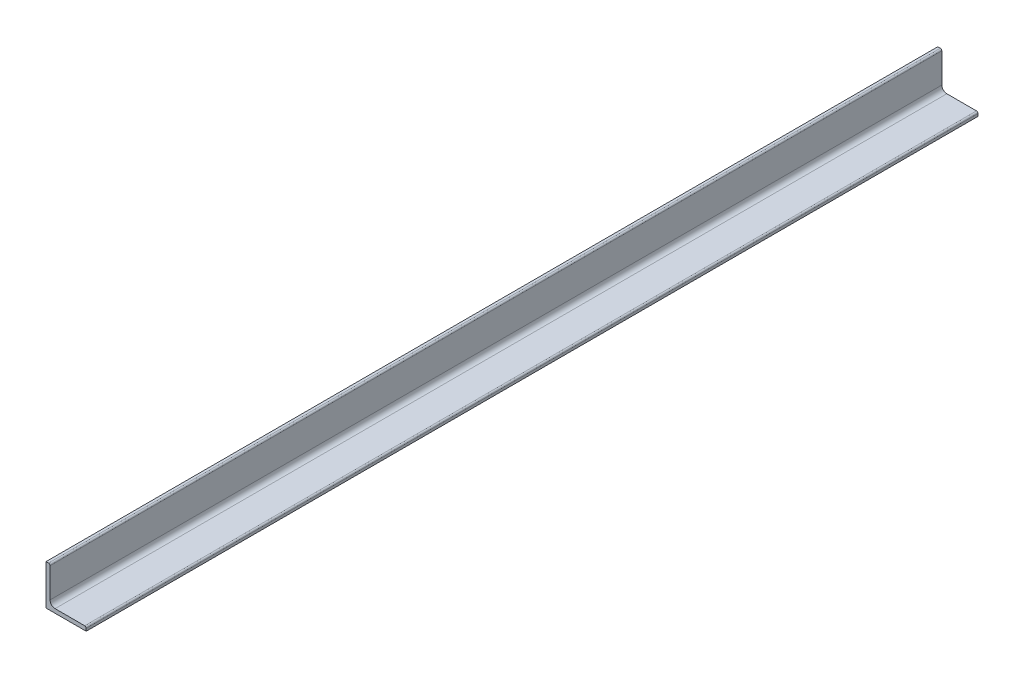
ISO-10303-21;
HEADER;
FILE_DESCRIPTION(('STEP AP214'),'2;1');
FILE_NAME('part.step','',(''),(''),'','','');
FILE_SCHEMA(('AUTOMOTIVE_DESIGN { 1 0 10303 214 1 1 1 1 }'));
ENDSEC;
DATA;
#1=APPLICATION_CONTEXT('core data for automotive mechanical design processes');
#2=APPLICATION_PROTOCOL_DEFINITION('international standard','automotive_design',2000,#1);
#3=PRODUCT_CONTEXT('',#1,'mechanical');
#4=PRODUCT('Part','Part','',(#3));
#5=PRODUCT_RELATED_PRODUCT_CATEGORY('part','',(#4));
#6=PRODUCT_DEFINITION_FORMATION('','',#4);
#7=PRODUCT_DEFINITION_CONTEXT('part definition',#1,'design');
#8=PRODUCT_DEFINITION('design','',#6,#7);
#9=PRODUCT_DEFINITION_SHAPE('','',#8);
#10=(LENGTH_UNIT() NAMED_UNIT(*) SI_UNIT(.MILLI.,.METRE.));
#11=(NAMED_UNIT(*) PLANE_ANGLE_UNIT() SI_UNIT($,.RADIAN.));
#12=(NAMED_UNIT(*) SI_UNIT($,.STERADIAN.) SOLID_ANGLE_UNIT());
#13=UNCERTAINTY_MEASURE_WITH_UNIT(LENGTH_MEASURE(1.E-05),#10,'distance_accuracy_value','');
#14=(GEOMETRIC_REPRESENTATION_CONTEXT(3) GLOBAL_UNCERTAINTY_ASSIGNED_CONTEXT((#13)) GLOBAL_UNIT_ASSIGNED_CONTEXT((#10,
#11,#12)) REPRESENTATION_CONTEXT('',''));
#15=CARTESIAN_POINT('',(0.,0.,0.));
#16=DIRECTION('',(0.,0.,1.));
#17=DIRECTION('',(1.,0.,0.));
#18=AXIS2_PLACEMENT_3D('',#15,#16,#17);
#19=CARTESIAN_POINT('',(2.49999999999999,40.,443.5));
#20=DIRECTION('',(0.,-1.,0.));
#21=DIRECTION('',(0.,0.,-1.));
#22=AXIS2_PLACEMENT_3D('',#19,#20,#21);
#23=PLANE('',#22);
#24=DIRECTION('',(-1.,0.,0.));
#25=VECTOR('',#24,1.);
#26=CARTESIAN_POINT('',(2.49999999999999,40.,-443.5));
#27=LINE('',#26,#25);
#28=CARTESIAN_POINT('',(2.49999999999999,40.,-443.5));
#29=VERTEX_POINT('',#28);
#30=CARTESIAN_POINT('',(0.,40.,-443.5));
#31=VERTEX_POINT('',#30);
#32=EDGE_CURVE('E143',#29,#31,#27,.T.);
#33=ORIENTED_EDGE('',*,*,#32,.T.);
#34=DIRECTION('',(0.,0.,-1.));
#35=VECTOR('',#34,1.);
#36=CARTESIAN_POINT('',(0.,40.,443.5));
#37=LINE('',#36,#35);
#38=CARTESIAN_POINT('',(0.,40.,443.5));
#39=VERTEX_POINT('',#38);
#40=EDGE_CURVE('E11',#39,#31,#37,.T.);
#41=ORIENTED_EDGE('',*,*,#40,.F.);
#42=DIRECTION('',(-1.,0.,0.));
#43=VECTOR('',#42,1.);
#44=CARTESIAN_POINT('',(2.49999999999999,40.,443.5));
#45=LINE('',#44,#43);
#46=CARTESIAN_POINT('',(2.49999999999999,40.,443.5));
#47=VERTEX_POINT('',#46);
#48=EDGE_CURVE('E159',#47,#39,#45,.T.);
#49=ORIENTED_EDGE('',*,*,#48,.F.);
#50=DIRECTION('',(0.,0.,-1.));
#51=VECTOR('',#50,1.);
#52=CARTESIAN_POINT('',(2.49999999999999,40.,443.5));
#53=LINE('',#52,#51);
#54=EDGE_CURVE('E139',#47,#29,#53,.T.);
#55=ORIENTED_EDGE('',*,*,#54,.T.);
#56=EDGE_LOOP('',(#33,#41,#49,#55));
#57=FACE_BOUND('',#56,.T.);
#58=ADVANCED_FACE('F41',(#57),#23,.F.);
#59=CARTESIAN_POINT('',(0.,40.,443.5));
#60=DIRECTION('',(1.,0.,0.));
#61=DIRECTION('',(0.,1.,0.));
#62=AXIS2_PLACEMENT_3D('',#59,#60,#61);
#63=PLANE('',#62);
#64=DIRECTION('',(0.,-1.,0.));
#65=VECTOR('',#64,1.);
#66=CARTESIAN_POINT('',(0.,40.,-443.5));
#67=LINE('',#66,#65);
#68=CARTESIAN_POINT('',(0.,0.,-443.5));
#69=VERTEX_POINT('',#68);
#70=EDGE_CURVE('E146',#31,#69,#67,.T.);
#71=ORIENTED_EDGE('',*,*,#70,.T.);
#72=DIRECTION('',(0.,0.,-1.));
#73=VECTOR('',#72,1.);
#74=CARTESIAN_POINT('',(0.,0.,443.5));
#75=LINE('',#74,#73);
#76=CARTESIAN_POINT('',(0.,0.,443.5));
#77=VERTEX_POINT('',#76);
#78=EDGE_CURVE('E49',#77,#69,#75,.T.);
#79=ORIENTED_EDGE('',*,*,#78,.F.);
#80=DIRECTION('',(0.,-1.,0.));
#81=VECTOR('',#80,1.);
#82=CARTESIAN_POINT('',(0.,40.,443.5));
#83=LINE('',#82,#81);
#84=EDGE_CURVE('E103',#39,#77,#83,.T.);
#85=ORIENTED_EDGE('',*,*,#84,.F.);
#86=ORIENTED_EDGE('',*,*,#40,.T.);
#87=EDGE_LOOP('',(#71,#79,#85,#86));
#88=FACE_BOUND('',#87,.T.);
#89=ADVANCED_FACE('F202',(#88),#63,.F.);
#90=CARTESIAN_POINT('',(0.,0.,443.5));
#91=DIRECTION('',(0.,1.,0.));
#92=DIRECTION('',(0.,0.,1.));
#93=AXIS2_PLACEMENT_3D('',#90,#91,#92);
#94=PLANE('',#93);
#95=DIRECTION('',(1.,0.,0.));
#96=VECTOR('',#95,1.);
#97=CARTESIAN_POINT('',(0.,0.,-443.5));
#98=LINE('',#97,#96);
#99=CARTESIAN_POINT('',(40.,0.,-443.5));
#100=VERTEX_POINT('',#99);
#101=EDGE_CURVE('E148',#69,#100,#98,.T.);
#102=ORIENTED_EDGE('',*,*,#101,.T.);
#103=DIRECTION('',(0.,0.,-1.));
#104=VECTOR('',#103,1.);
#105=CARTESIAN_POINT('',(40.,0.,443.5));
#106=LINE('',#105,#104);
#107=CARTESIAN_POINT('',(40.,0.,443.5));
#108=VERTEX_POINT('',#107);
#109=EDGE_CURVE('E169',#108,#100,#106,.T.);
#110=ORIENTED_EDGE('',*,*,#109,.F.);
#111=DIRECTION('',(1.,0.,0.));
#112=VECTOR('',#111,1.);
#113=CARTESIAN_POINT('',(0.,0.,443.5));
#114=LINE('',#113,#112);
#115=EDGE_CURVE('E177',#77,#108,#114,.T.);
#116=ORIENTED_EDGE('',*,*,#115,.F.);
#117=ORIENTED_EDGE('',*,*,#78,.T.);
#118=EDGE_LOOP('',(#102,#110,#116,#117));
#119=FACE_BOUND('',#118,.T.);
#120=ADVANCED_FACE('F175',(#119),#94,.F.);
#121=CARTESIAN_POINT('',(40.,0.,443.5));
#122=DIRECTION('',(-1.,0.,0.));
#123=DIRECTION('',(0.,0.,1.));
#124=AXIS2_PLACEMENT_3D('',#121,#122,#123);
#125=PLANE('',#124);
#126=DIRECTION('',(0.,1.,0.));
#127=VECTOR('',#126,1.);
#128=CARTESIAN_POINT('',(40.,0.,-443.5));
#129=LINE('',#128,#127);
#130=CARTESIAN_POINT('',(40.,2.49999999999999,-443.5));
#131=VERTEX_POINT('',#130);
#132=EDGE_CURVE('E150',#100,#131,#129,.T.);
#133=ORIENTED_EDGE('',*,*,#132,.T.);
#134=DIRECTION('',(0.,0.,-1.));
#135=VECTOR('',#134,1.);
#136=CARTESIAN_POINT('',(40.,2.49999999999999,443.5));
#137=LINE('',#136,#135);
#138=CARTESIAN_POINT('',(40.,2.49999999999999,443.5));
#139=VERTEX_POINT('',#138);
#140=EDGE_CURVE('E166',#139,#131,#137,.T.);
#141=ORIENTED_EDGE('',*,*,#140,.F.);
#142=DIRECTION('',(0.,1.,0.));
#143=VECTOR('',#142,1.);
#144=CARTESIAN_POINT('',(40.,0.,443.5));
#145=LINE('',#144,#143);
#146=EDGE_CURVE('E193',#108,#139,#145,.T.);
#147=ORIENTED_EDGE('',*,*,#146,.F.);
#148=ORIENTED_EDGE('',*,*,#109,.T.);
#149=EDGE_LOOP('',(#133,#141,#147,#148));
#150=FACE_BOUND('',#149,.T.);
#151=ADVANCED_FACE('F186',(#150),#125,.F.);
#152=CARTESIAN_POINT('',(38.5,2.5,443.5));
#153=DIRECTION('',(0.,0.,-1.));
#154=DIRECTION('',(-1.,0.,0.));
#155=AXIS2_PLACEMENT_3D('',#152,#153,#154);
#156=CYLINDRICAL_SURFACE('',#155,1.5);
#157=CARTESIAN_POINT('',(38.5,2.5,-443.5));
#158=DIRECTION('',(0.,0.,1.));
#159=DIRECTION('',(1.,0.,0.));
#160=AXIS2_PLACEMENT_3D('',#157,#158,#159);
#161=CIRCLE('',#160,1.5);
#162=CARTESIAN_POINT('',(38.5,4.,-443.5));
#163=VERTEX_POINT('',#162);
#164=EDGE_CURVE('E152',#131,#163,#161,.T.);
#165=ORIENTED_EDGE('',*,*,#164,.T.);
#166=DIRECTION('',(0.,0.,-1.));
#167=VECTOR('',#166,1.);
#168=CARTESIAN_POINT('',(38.5,4.,443.5));
#169=LINE('',#168,#167);
#170=CARTESIAN_POINT('',(38.5,4.,443.5));
#171=VERTEX_POINT('',#170);
#172=EDGE_CURVE('E163',#171,#163,#169,.T.);
#173=ORIENTED_EDGE('',*,*,#172,.F.);
#174=CARTESIAN_POINT('',(38.5,2.5,443.5));
#175=DIRECTION('',(0.,0.,1.));
#176=DIRECTION('',(1.,0.,0.));
#177=AXIS2_PLACEMENT_3D('',#174,#175,#176);
#178=CIRCLE('',#177,1.5);
#179=EDGE_CURVE('E192',#139,#171,#178,.T.);
#180=ORIENTED_EDGE('',*,*,#179,.F.);
#181=ORIENTED_EDGE('',*,*,#140,.T.);
#182=EDGE_LOOP('',(#165,#173,#180,#181));
#183=FACE_BOUND('',#182,.T.);
#184=ADVANCED_FACE('F190',(#183),#156,.T.);
#185=CARTESIAN_POINT('',(38.5,4.,443.5));
#186=DIRECTION('',(0.,-1.,0.));
#187=DIRECTION('',(1.,0.,0.));
#188=AXIS2_PLACEMENT_3D('',#185,#186,#187);
#189=PLANE('',#188);
#190=DIRECTION('',(-1.,0.,0.));
#191=VECTOR('',#190,1.);
#192=CARTESIAN_POINT('',(38.5,4.,-443.5));
#193=LINE('',#192,#191);
#194=CARTESIAN_POINT('',(9.00000000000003,4.,-443.5));
#195=VERTEX_POINT('',#194);
#196=EDGE_CURVE('E154',#163,#195,#193,.T.);
#197=ORIENTED_EDGE('',*,*,#196,.T.);
#198=DIRECTION('',(0.,0.,-1.));
#199=VECTOR('',#198,1.);
#200=CARTESIAN_POINT('',(9.00000000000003,4.,443.5));
#201=LINE('',#200,#199);
#202=CARTESIAN_POINT('',(9.00000000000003,4.,443.5));
#203=VERTEX_POINT('',#202);
#204=EDGE_CURVE('E134',#203,#195,#201,.T.);
#205=ORIENTED_EDGE('',*,*,#204,.F.);
#206=DIRECTION('',(-1.,0.,0.));
#207=VECTOR('',#206,1.);
#208=CARTESIAN_POINT('',(38.5,4.,443.5));
#209=LINE('',#208,#207);
#210=EDGE_CURVE('E125',#171,#203,#209,.T.);
#211=ORIENTED_EDGE('',*,*,#210,.F.);
#212=ORIENTED_EDGE('',*,*,#172,.T.);
#213=EDGE_LOOP('',(#197,#205,#211,#212));
#214=FACE_BOUND('',#213,.T.);
#215=ADVANCED_FACE('F214',(#214),#189,.F.);
#216=CARTESIAN_POINT('',(9.,9.,443.5));
#217=DIRECTION('',(0.,0.,-1.));
#218=DIRECTION('',(-1.,0.,0.));
#219=AXIS2_PLACEMENT_3D('',#216,#217,#218);
#220=CYLINDRICAL_SURFACE('',#219,5.);
#221=CARTESIAN_POINT('',(9.,9.,-443.5));
#222=DIRECTION('',(0.,0.,-1.));
#223=DIRECTION('',(-1.,0.,0.));
#224=AXIS2_PLACEMENT_3D('',#221,#222,#223);
#225=CIRCLE('',#224,5.);
#226=CARTESIAN_POINT('',(4.,9.00000000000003,-443.5));
#227=VERTEX_POINT('',#226);
#228=EDGE_CURVE('E133',#195,#227,#225,.T.);
#229=ORIENTED_EDGE('',*,*,#228,.T.);
#230=DIRECTION('',(0.,0.,-1.));
#231=VECTOR('',#230,1.);
#232=CARTESIAN_POINT('',(4.,9.00000000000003,443.5));
#233=LINE('',#232,#231);
#234=CARTESIAN_POINT('',(4.,9.00000000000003,443.5));
#235=VERTEX_POINT('',#234);
#236=EDGE_CURVE('E130',#235,#227,#233,.T.);
#237=ORIENTED_EDGE('',*,*,#236,.F.);
#238=CARTESIAN_POINT('',(9.,9.,443.5));
#239=DIRECTION('',(0.,0.,-1.));
#240=DIRECTION('',(-1.,0.,0.));
#241=AXIS2_PLACEMENT_3D('',#238,#239,#240);
#242=CIRCLE('',#241,5.);
#243=EDGE_CURVE('E119',#203,#235,#242,.T.);
#244=ORIENTED_EDGE('',*,*,#243,.F.);
#245=ORIENTED_EDGE('',*,*,#204,.T.);
#246=EDGE_LOOP('',(#229,#237,#244,#245));
#247=FACE_BOUND('',#246,.T.);
#248=ADVANCED_FACE('F131',(#247),#220,.F.);
#249=CARTESIAN_POINT('',(4.,9.00000000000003,443.5));
#250=DIRECTION('',(-1.,0.,0.));
#251=DIRECTION('',(0.,-1.,0.));
#252=AXIS2_PLACEMENT_3D('',#249,#250,#251);
#253=PLANE('',#252);
#254=DIRECTION('',(0.,1.,0.));
#255=VECTOR('',#254,1.);
#256=CARTESIAN_POINT('',(4.,9.00000000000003,-443.5));
#257=LINE('',#256,#255);
#258=CARTESIAN_POINT('',(4.,38.5,-443.5));
#259=VERTEX_POINT('',#258);
#260=EDGE_CURVE('E89',#227,#259,#257,.T.);
#261=ORIENTED_EDGE('',*,*,#260,.T.);
#262=DIRECTION('',(0.,0.,-1.));
#263=VECTOR('',#262,1.);
#264=CARTESIAN_POINT('',(4.,38.5,443.5));
#265=LINE('',#264,#263);
#266=CARTESIAN_POINT('',(4.,38.5,443.5));
#267=VERTEX_POINT('',#266);
#268=EDGE_CURVE('E135',#267,#259,#265,.T.);
#269=ORIENTED_EDGE('',*,*,#268,.F.);
#270=DIRECTION('',(0.,1.,0.));
#271=VECTOR('',#270,1.);
#272=CARTESIAN_POINT('',(4.,9.00000000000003,443.5));
#273=LINE('',#272,#271);
#274=EDGE_CURVE('E123',#235,#267,#273,.T.);
#275=ORIENTED_EDGE('',*,*,#274,.F.);
#276=ORIENTED_EDGE('',*,*,#236,.T.);
#277=EDGE_LOOP('',(#261,#269,#275,#276));
#278=FACE_BOUND('',#277,.T.);
#279=ADVANCED_FACE('F137',(#278),#253,.F.);
#280=CARTESIAN_POINT('',(2.5,38.5,443.5));
#281=DIRECTION('',(0.,0.,-1.));
#282=DIRECTION('',(-1.,0.,0.));
#283=AXIS2_PLACEMENT_3D('',#280,#281,#282);
#284=CYLINDRICAL_SURFACE('',#283,1.5);
#285=CARTESIAN_POINT('',(2.5,38.5,-443.5));
#286=DIRECTION('',(0.,0.,1.));
#287=DIRECTION('',(1.,0.,0.));
#288=AXIS2_PLACEMENT_3D('',#285,#286,#287);
#289=CIRCLE('',#288,1.5);
#290=EDGE_CURVE('E95',#259,#29,#289,.T.);
#291=ORIENTED_EDGE('',*,*,#290,.T.);
#292=ORIENTED_EDGE('',*,*,#54,.F.);
#293=CARTESIAN_POINT('',(2.5,38.5,443.5));
#294=DIRECTION('',(0.,0.,1.));
#295=DIRECTION('',(1.,0.,0.));
#296=AXIS2_PLACEMENT_3D('',#293,#294,#295);
#297=CIRCLE('',#296,1.5);
#298=EDGE_CURVE('E57',#267,#47,#297,.T.);
#299=ORIENTED_EDGE('',*,*,#298,.F.);
#300=ORIENTED_EDGE('',*,*,#268,.T.);
#301=EDGE_LOOP('',(#291,#292,#299,#300));
#302=FACE_BOUND('',#301,.T.);
#303=ADVANCED_FACE('F222',(#302),#284,.T.);
#304=CARTESIAN_POINT('',(38.5,2.5,443.5));
#305=DIRECTION('',(0.,0.,1.));
#306=DIRECTION('',(1.,0.,0.));
#307=AXIS2_PLACEMENT_3D('',#304,#305,#306);
#308=PLANE('',#307);
#309=ORIENTED_EDGE('',*,*,#48,.T.);
#310=ORIENTED_EDGE('',*,*,#84,.T.);
#311=ORIENTED_EDGE('',*,*,#115,.T.);
#312=ORIENTED_EDGE('',*,*,#146,.T.);
#313=ORIENTED_EDGE('',*,*,#179,.T.);
#314=ORIENTED_EDGE('',*,*,#210,.T.);
#315=ORIENTED_EDGE('',*,*,#243,.T.);
#316=ORIENTED_EDGE('',*,*,#274,.T.);
#317=ORIENTED_EDGE('',*,*,#298,.T.);
#318=EDGE_LOOP('',(#309,#310,#311,#312,#313,#314,#315,#316,#317));
#319=FACE_BOUND('',#318,.T.);
#320=ADVANCED_FACE('F121',(#319),#308,.T.);
#321=CARTESIAN_POINT('',(38.5,2.5,-443.5));
#322=DIRECTION('',(0.,0.,1.));
#323=DIRECTION('',(1.,0.,0.));
#324=AXIS2_PLACEMENT_3D('',#321,#322,#323);
#325=PLANE('',#324);
#326=ORIENTED_EDGE('',*,*,#32,.F.);
#327=ORIENTED_EDGE('',*,*,#290,.F.);
#328=ORIENTED_EDGE('',*,*,#260,.F.);
#329=ORIENTED_EDGE('',*,*,#228,.F.);
#330=ORIENTED_EDGE('',*,*,#196,.F.);
#331=ORIENTED_EDGE('',*,*,#164,.F.);
#332=ORIENTED_EDGE('',*,*,#132,.F.);
#333=ORIENTED_EDGE('',*,*,#101,.F.);
#334=ORIENTED_EDGE('',*,*,#70,.F.);
#335=EDGE_LOOP('',(#326,#327,#328,#329,#330,#331,#332,#333,#334));
#336=FACE_BOUND('',#335,.T.);
#337=ADVANCED_FACE('F181',(#336),#325,.F.);
#338=CLOSED_SHELL('',(#58,#89,#120,#151,#184,#215,#248,#279,#303,#320,#337));
#339=MANIFOLD_SOLID_BREP('B2',#338);
#340=ADVANCED_BREP_SHAPE_REPRESENTATION('',(#18,#339),#14);
#341=SHAPE_DEFINITION_REPRESENTATION(#9,#340);
ENDSEC;
END-ISO-10303-21;
